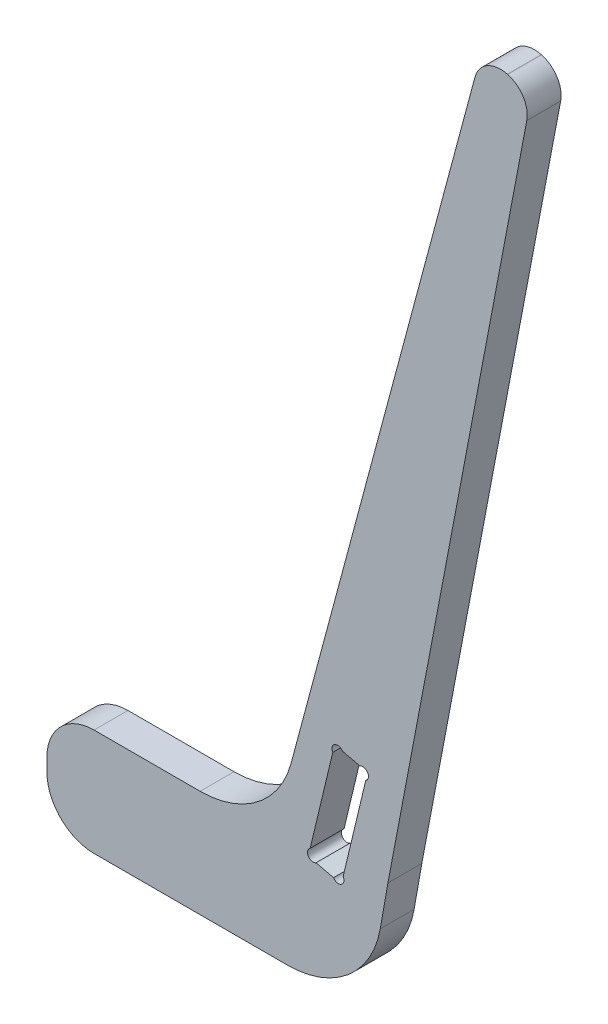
from build123d import *

# Parameters (mm, degrees)
BOSS_EXTRU_1_DEPTH      = 18
CONG_2_R                = 25
CONG_3_R                = 14
ESQUISSE4_R             = 3
ENL_V_MAT_EXTRU_2_DEPTH = 861.817649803


with BuildPart() as part:
    # Esquisse1 → Boss.-Extru.1 (new body)
    with BuildSketch(Plane.XY):
        with BuildLine():
            Line((739.058652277, 400.975801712), (657.61048501, 97.00710329))
            Line((657.61048501, 97.00710329), (637.838508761, 23.217083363))
            ThreePointArc((637.838508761, 23.217083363), (619.980288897, -3.509631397), (589.542217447, -13.841964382))
            Line((589.542217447, -13.841964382), (508.208645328, -13.841964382))
            Line((508.208645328, -13.841964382), (508.208645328, -70.596163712))
            Line((508.208645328, -70.596163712), (635.902894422, -70.596163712))
            ThreePointArc((635.902894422, -70.596163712), (668.042274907, -58.898385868), (685.143282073, -29.278572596))
            Line((685.143282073, -29.278572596), (689.222605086, -6.143582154))
            Line((689.222605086, -6.143582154), (694.148508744, 19.745500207))
            Line((694.148508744, 19.745500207), (703.001084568, 66.272001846))
            Line((703.001084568, 66.272001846), (703.02954857, 66.421600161))
            Line((703.02954857, 66.421600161), (716.009843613, 134.642164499))
            Line((716.009843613, 134.642164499), (765.344881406, 393.932427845))
            Line((765.344881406, 393.932427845), (739.058652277, 400.975801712))
        make_face()
        Polygon((646.960604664, -14.951090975), (660.934943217, 43.398869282), (662.997925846, 42.904801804), (665.060908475, 42.410734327), (678.439931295, 39.206567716), (664.465592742, -19.143392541), align=None, mode=Mode.SUBTRACT)
    extrude(amount=BOSS_EXTRU_1_DEPTH)

    # Cong_2
    cong_2_edges = [part.edges().sort_by_distance(p)[0] for p in [
        (508.208645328, -70.596163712, 9),
        (508.208645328, -13.841964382, 9),
    ]]
    fillet(cong_2_edges, radius=CONG_2_R)

    # Cong_3
    cong_3_edges = [part.edges().sort_by_distance(p)[0] for p in [
        (739.058652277, 400.975801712, 9),
        (765.344881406, 393.932427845, 9),
    ]]
    fillet(cong_3_edges, radius=CONG_3_R)

    # Esquisse4 → Enl_v. mat.-Extru.2 (cut, through all)
    with BuildSketch(Plane.XY.offset(18)):
        with Locations((662.503858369, 40.841819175)):
            Circle(ESQUISSE4_R)
        with Locations((662.89667759, -16.586342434)):
            Circle(ESQUISSE4_R)
        with Locations((675.882881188, 37.637652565)):
            Circle(ESQUISSE4_R)
        with Locations((649.517654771, -13.382175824)):
            Circle(ESQUISSE4_R)
    extrude(amount=-ENL_V_MAT_EXTRU_2_DEPTH, mode=Mode.SUBTRACT)


solid = part.part
